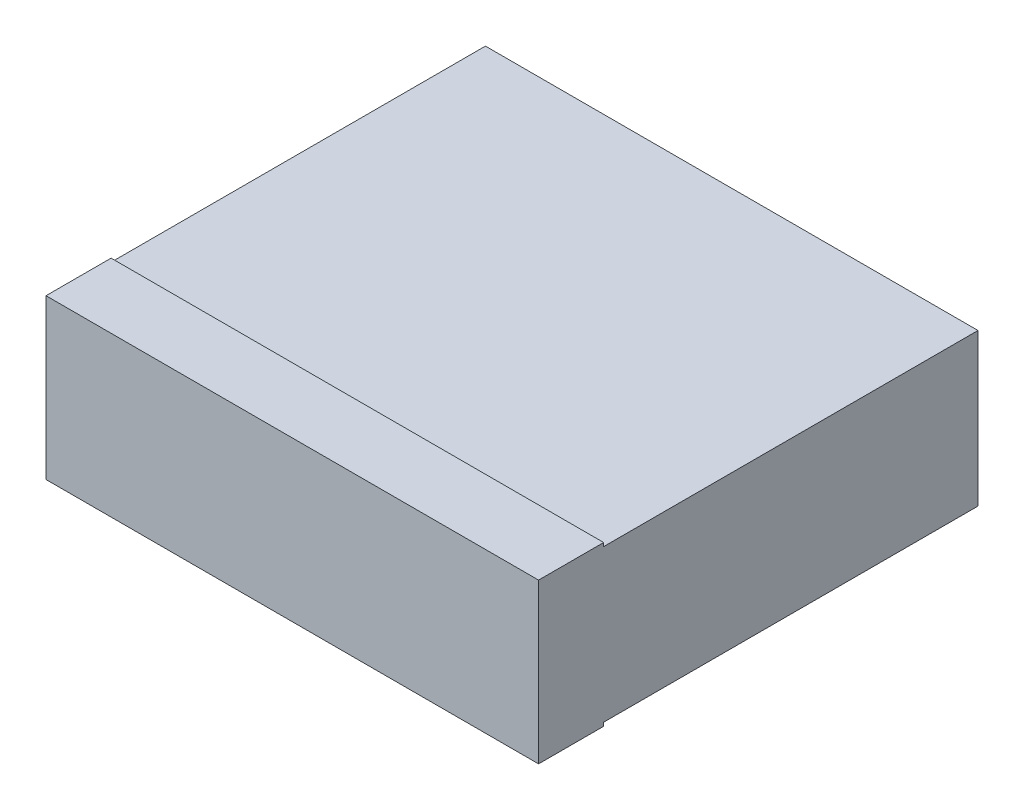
from build123d import *

# Parameters (mm, degrees)
SKETCH1_W           = 158.75
SKETCH1_H           = 49.022
BOSS_EXTRUDE1_DEPTH = 120.65
SKETCH2_W           = 158.75
SKETCH2_H           = 51.308
BOSS_EXTRUDE2_DEPTH = 20.9804


with BuildPart() as part:
    # Sketch1 → Boss-Extrude1 (new body)
    with BuildSketch(Plane.XY):
        Rectangle(SKETCH1_W, SKETCH1_H)
    extrude(amount=BOSS_EXTRUDE1_DEPTH)

    # Sketch2 → Boss-Extrude2 (add)
    with BuildSketch(Plane.XY.offset(120.65)):
        Rectangle(SKETCH2_W, SKETCH2_H)
    extrude(amount=BOSS_EXTRUDE2_DEPTH)


solid = part.part
